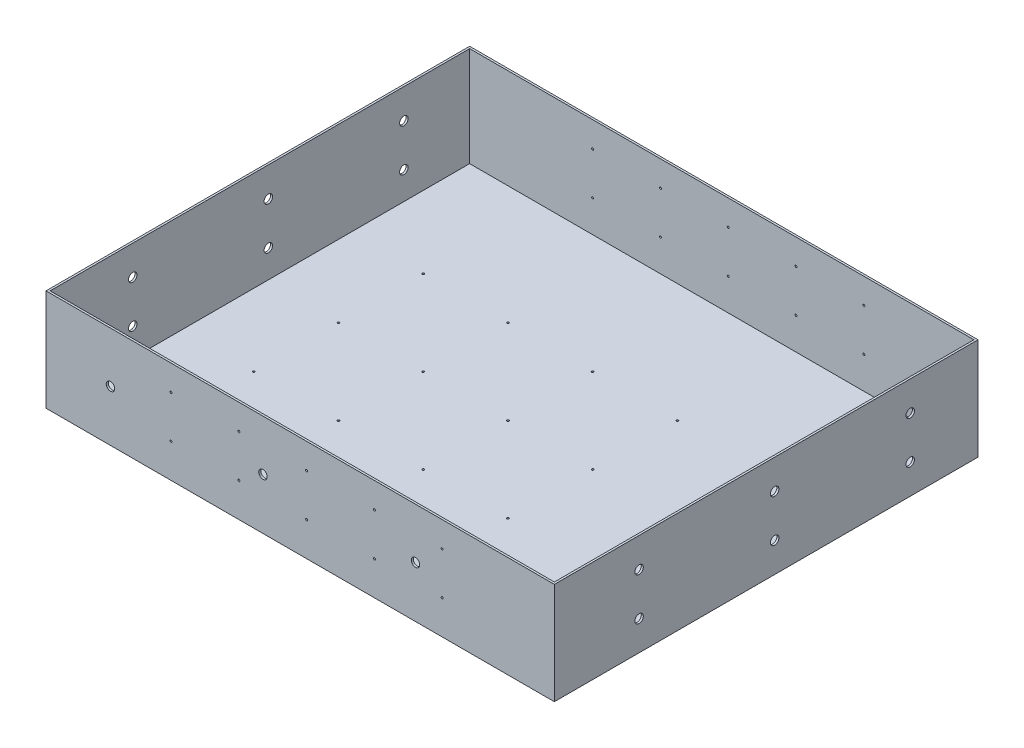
from build123d import *

# Parameters (mm, degrees)
SKETCH1_W                              = 762
SKETCH1_H                              = 635
EXTRUDE1_DEPTH                         = 152.4
SHELL1_T                               = -3.048
SKETCH2_R                              = 6.35
CONNECTOR_MOUNT_CUT_EXTRUDE1_DEPTH     = 929.403877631
LPATTERN1_COUNT                        = 3
LPATTERN1_PITCH                        = 203.2
LPATTERN1_COUNT_DIR2                   = 2
LPATTERN1_PITCH_DIR2                   = 63.5
SKETCH3_R                              = 1.524
CLIP_MOUNT_CUT_EXTRUDE2_DEPTH          = 828.354071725
LPATTERN2_COUNT                        = 5
LPATTERN2_PITCH                        = 101.6
LPATTERN2_COUNT_DIR2                   = 2
LPATTERN2_PITCH_DIR2                   = 63.5
LOWER_CONNECTOR_MNT_CUT_EXTRUDE1_REACH = 829.354
SKETCH4_R                              = 6.35
LPATTERN3_COUNT                        = 3
LPATTERN3_PITCH                        = 228.6
SKETCH5_R                              = 1.524
CUT_EXTRUDE1_DEPTH                     = 3.048
LPATTERN4_COUNT                        = 3
LPATTERN4_PITCH                        = 127
LPATTERN4_COUNT_DIR2                   = 5
LPATTERN4_PITCH_DIR2                   = 127


with BuildPart() as part:
    # Sketch1 → Extrude1 (new body)
    with BuildSketch(Plane(origin=(0, 0, 0), x_dir=(1, 0, 0), z_dir=(0, 1, 0))):
        with Locations((-127, 190.5)):
            Rectangle(SKETCH1_W, SKETCH1_H)
    extrude(amount=EXTRUDE1_DEPTH)

    # Shell1
    shell1_openings = [part.faces().sort_by_distance(p)[0] for p in [
        (-127, 152.4, -190.5),
    ]]
    offset(amount=SHELL1_T, openings=shell1_openings, kind=Kind.INTERSECTION)

    # Sketch2 → Connector mount--Cut-Extrude1 (cut, through all)
    with BuildSketch(Plane.ZY.offset(508)):
        with Locations((-406.4, 107.95)):
            Circle(SKETCH2_R)
    connector_mount_cut_extrude1 = extrude(amount=-CONNECTOR_MOUNT_CUT_EXTRUDE1_DEPTH, mode=Mode.SUBTRACT)

    # LPattern1: Connector mount--Cut-Extrude1 3 × 2
    with Locations(*[(0, -j * LPATTERN1_PITCH_DIR2, i * LPATTERN1_PITCH) for i in range(LPATTERN1_COUNT) for j in range(LPATTERN1_COUNT_DIR2) if (i, j) != (0, 0)]):
        add(connector_mount_cut_extrude1, mode=Mode.SUBTRACT)

    # Sketch3 → Clip Mount --Cut-Extrude2 (cut, through all)
    with BuildSketch(Plane(origin=(0, 0, -508), x_dir=(-1, 0, 0), z_dir=(0, 0, -1))):
        with Locations((-85.852, 114.3)):
            Circle(SKETCH3_R)
    clip_mount_cut_extrude2 = extrude(amount=-CLIP_MOUNT_CUT_EXTRUDE2_DEPTH, mode=Mode.SUBTRACT)

    # LPattern2: Clip Mount --Cut-Extrude2 5 × 2
    with Locations(*[(-i * LPATTERN2_PITCH, -j * LPATTERN2_PITCH_DIR2, 0) for i in range(LPATTERN2_COUNT) for j in range(LPATTERN2_COUNT_DIR2) if (i, j) != (0, 0)]):
        add(clip_mount_cut_extrude2, mode=Mode.SUBTRACT)

    # Sketch4 → Lower Connector Mnt--Cut-Extrude1 (cut, up to next)
    with BuildSketch(Plane.XY.offset(127), mode=Mode.PRIVATE) as lower_connector_mnt_cut_extrude1_sk1:
        with Locations((-411.374764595, 76.774011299)):
            Circle(SKETCH4_R)
    lower_connector_mnt_cut_extrude1_tool1 = extrude(lower_connector_mnt_cut_extrude1_sk1.sketch, amount=-LOWER_CONNECTOR_MNT_CUT_EXTRUDE1_REACH, mode=Mode.PRIVATE) & part.part
    lower_connector_mnt_cut_extrude1 = lower_connector_mnt_cut_extrude1_tool1.solids().sort_by_distance((-411.374765, 76.774011, 127))[0]
    add(lower_connector_mnt_cut_extrude1, mode=Mode.SUBTRACT)

    # LPattern3: Lower Connector Mnt--Cut-Extrude1 ×3
    with Locations(*[(i * LPATTERN3_PITCH, 0, 0) for i in range(1, LPATTERN3_COUNT)]):
        add(lower_connector_mnt_cut_extrude1, mode=Mode.SUBTRACT)

    # Sketch5 → Cut-Extrude1 (cut)
    with BuildSketch(Plane(origin=(0, 3.048, 0), x_dir=(-1, 0, 0), z_dir=(0, 1, 0))):
        with Locations(Location((-111.252, -327.152, 0), (0, 0, 90))):
            Circle(SKETCH5_R)
    cut_extrude1 = extrude(amount=-CUT_EXTRUDE1_DEPTH, mode=Mode.SUBTRACT)

    # LPattern4: Cut-Extrude1 3 × 5
    with Locations(*[(-j * LPATTERN4_PITCH_DIR2, 0, i * LPATTERN4_PITCH) for i in range(LPATTERN4_COUNT) for j in range(LPATTERN4_COUNT_DIR2) if (i, j) != (0, 0)]):
        add(cut_extrude1, mode=Mode.SUBTRACT)


solid = part.part
